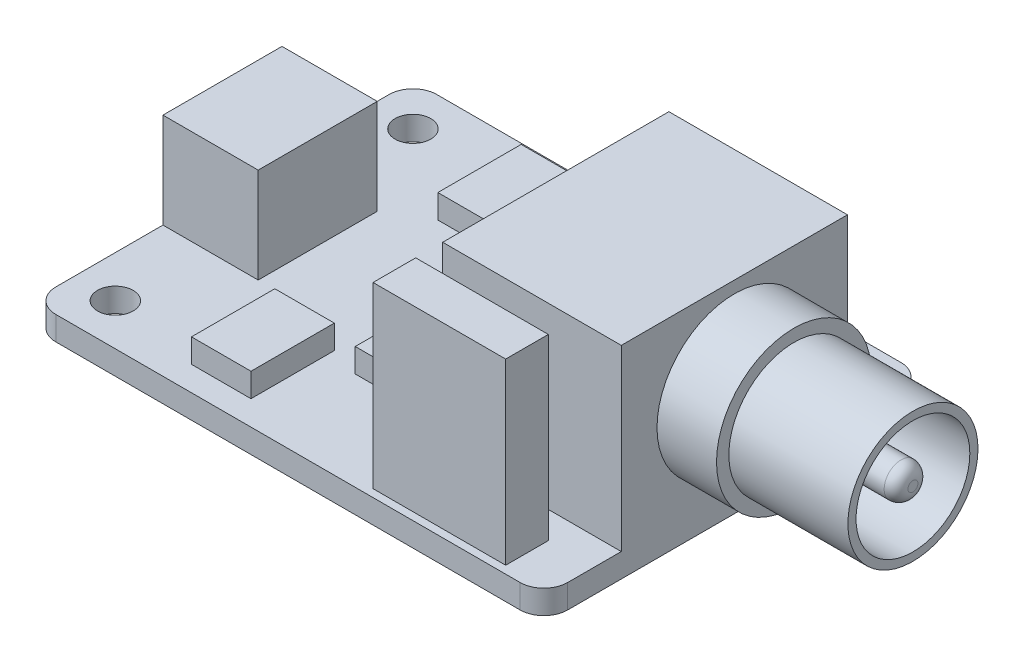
from build123d import *
from OCP.BRepFilletAPI import BRepFilletAPI_MakeChamfer

# Parameters (mm, degrees)
SKETCH1_W           = 43
SKETCH1_H           = 32
SKETCH1_R           = 1.5
BOSS_EXTRUDE1_DEPTH = 2
FILLET1_R           = 2
SKETCH2_W           = 15
SKETCH2_H           = 19
SKETCH2_W_2         = 11.140552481
SKETCH2_H_2         = 3.582781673
BOSS_EXTRUDE2_DEPTH = 15
SKETCH3_W           = 8
SKETCH3_H           = 10
BOSS_EXTRUDE3_DEPTH = 8
SKETCH4_W           = 5
SKETCH4_H           = 7
BOSS_EXTRUDE4_DEPTH = 2
SKETCH5_W           = 8
SKETCH5_H           = 6
SKETCH5_W_2         = 1
SKETCH5_H_2         = 1
CUT_EXTRUDE1_DEPTH  = 7
DRAFT1_ANGLE        = 1
CHAMFER1_SIZE       = 2.5
CHAMFER1_SIZE2      = 0.351352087
CHAMFER1_SIZE2_2    = 0.352269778
CHAMFER1_SIZE2_3    = 0.350545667
SKETCH6_R           = 6.5
BOSS_EXTRUDE5_DEPTH = 5
SKETCH7_R           = 5.464716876
BOSS_EXTRUDE6_DEPTH = 10
SKETCH8_R           = 4.778839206
SKETCH8_R_2         = 1.418417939
CUT_EXTRUDE2_DEPTH  = 15
FILLET3_R           = 1


with BuildPart() as part:
    # Sketch1 → Boss-Extrude1 (new body)
    with BuildSketch(Plane(origin=(0, 0, 0), x_dir=(1, 0, 0), z_dir=(0, 1, 0))):
        with Locations((-157.69047619, 62.928571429)):
            Rectangle(SKETCH1_W, SKETCH1_H)
        with Locations(Location((-175.69047619, 75.428571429, 0), (0, 0, 270))):
            Circle(SKETCH1_R, mode=Mode.SUBTRACT)
        with Locations(Location((-175.69047619, 50.428571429, 0), (0, 0, 270))):
            Circle(SKETCH1_R, mode=Mode.SUBTRACT)
    extrude(amount=BOSS_EXTRUDE1_DEPTH)

    # Fillet1
    fillet1_edges = [part.edges().sort_by_distance(p)[0] for p in [
        (-179.19047619, 1, -78.928571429),
        (-136.19047619, 1, -78.928571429),
        (-136.19047619, 1, -46.928571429),
        (-179.19047619, 1, -46.928571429),
    ]]
    fillet(fillet1_edges, radius=FILLET1_R)

    # Sketch2 → Boss-Extrude2 (add)
    with BuildSketch(Plane(origin=(0, 2, 0), x_dir=(1, 0, 0), z_dir=(0, 1, 0))):
        with Locations((-143.69047619, 62.928571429)):
            Rectangle(SKETCH2_W, SKETCH2_H)
        with Locations((-145.62019995, 49.369059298)):
            Rectangle(SKETCH2_W_2, SKETCH2_H_2)
    extrude(amount=BOSS_EXTRUDE2_DEPTH)

    # Sketch3 → Boss-Extrude3 (add)
    with BuildSketch(Plane(origin=(0, 2, 0), x_dir=(1, 0, 0), z_dir=(0, 1, 0))):
        with Locations((-175.19047619, 62.928571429)):
            Rectangle(SKETCH3_W, SKETCH3_H)
    extrude(amount=BOSS_EXTRUDE3_DEPTH)

    # Sketch4 → Boss-Extrude4 (add)
    with BuildSketch(Plane(origin=(0, 2, 0), x_dir=(1, 0, 0), z_dir=(0, 1, 0))):
        with Locations((-157.781788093, 68.484522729)):
            Rectangle(SKETCH4_W, SKETCH4_H)
        with Locations((-157.781788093, 58.672517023)):
            Rectangle(SKETCH4_W, SKETCH4_H)
        with Locations((-165.512552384, 73.341751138)):
            Rectangle(SKETCH4_W, SKETCH4_H)
        with Locations((-165.361321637, 52.495882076)):
            Rectangle(SKETCH4_W, SKETCH4_H)
    extrude(amount=BOSS_EXTRUDE4_DEPTH)

    # Sketch5 → Cut-Extrude1 (cut)
    with BuildSketch(Plane.ZY.offset(179.19047619)):
        with Locations((-62.928571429, 6)):
            Rectangle(SKETCH5_W, SKETCH5_H)
        with Locations((-65.228571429, 6)):
            Rectangle(SKETCH5_W_2, SKETCH5_H_2, mode=Mode.SUBTRACT)
        with Locations((-62.928571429, 6)):
            Rectangle(SKETCH5_W_2, SKETCH5_H_2, mode=Mode.SUBTRACT)
        with Locations((-60.628571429, 6)):
            Rectangle(SKETCH5_W_2, SKETCH5_H_2, mode=Mode.SUBTRACT)
    extrude(amount=-CUT_EXTRUDE1_DEPTH, mode=Mode.SUBTRACT)

    # Draft1
    draft1_faces = [part.faces().sort_by_distance(p)[0] for p in [
        (-179.19047619, 6, -65.228571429),
        (-179.19047619, 6, -60.628571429),
        (-179.19047619, 6, -62.928571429),
    ]]
    draft(draft1_faces, Plane(origin=(-172.19047619, 6.5, -63.428571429), x_dir=(0, 0, 1), z_dir=(0, 1, 0)), DRAFT1_ANGLE)

    # Chamfer1: one chamfer whose edges measure the first distance from different faces: ONE call of the kernel's chamfer builder (chamfer() names one face for all edges)
    chamfer1_edges_1 = [part.edges().sort_by_distance(p)[0] for p in [
        (-179.199203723, 6, -65.728571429),
    ]]
    chamfer1_side_1 = [part.faces().sort_by_distance(p)[0] for p in [
        (-175.694841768, 5.99979246, -65.728571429),
    ]]
    chamfer1_edges_2 = [part.edges().sort_by_distance(p)[0] for p in [
        (-179.19047619, 6.5, -65.228571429),
    ]]
    chamfer1_side_2 = [part.faces().sort_by_distance(p)[0] for p in [
        (-175.69047619, 6.5, -65.228571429),
    ]]
    chamfer1_edges_3 = [part.edges().sort_by_distance(p)[0] for p in [
        (-179.199203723, 6, -64.728571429),
    ]]
    chamfer1_side_3 = [part.faces().sort_by_distance(p)[0] for p in [
        (-175.694841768, 5.99979246, -64.728571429),
    ]]
    chamfer1_edges_4 = [part.edges().sort_by_distance(p)[0] for p in [
        (-179.207931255, 5.5, -65.228571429),
    ]]
    chamfer1_side_4 = [part.faces().sort_by_distance(p)[0] for p in [
        (-175.699203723, 5.5, -65.228571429),
    ]]
    chamfer1_edges_5 = [part.edges().sort_by_distance(p)[0] for p in [
        (-179.199203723, 6, -63.428571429),
    ]]
    chamfer1_side_5 = [part.faces().sort_by_distance(p)[0] for p in [
        (-175.694841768, 5.99979246, -63.428571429),
    ]]
    chamfer1_edges_6 = [part.edges().sort_by_distance(p)[0] for p in [
        (-179.19047619, 6.5, -62.928571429),
    ]]
    chamfer1_side_6 = [part.faces().sort_by_distance(p)[0] for p in [
        (-175.69047619, 6.5, -62.928571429),
    ]]
    chamfer1_edges_7 = [part.edges().sort_by_distance(p)[0] for p in [
        (-179.199203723, 6, -62.428571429),
    ]]
    chamfer1_side_7 = [part.faces().sort_by_distance(p)[0] for p in [
        (-175.694841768, 5.99979246, -62.428571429),
    ]]
    chamfer1_edges_8 = [part.edges().sort_by_distance(p)[0] for p in [
        (-179.207931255, 5.5, -62.928571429),
    ]]
    chamfer1_side_8 = [part.faces().sort_by_distance(p)[0] for p in [
        (-175.699203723, 5.5, -62.928571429),
    ]]
    chamfer1_edges_9 = [part.edges().sort_by_distance(p)[0] for p in [
        (-179.199203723, 6, -61.128571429),
    ]]
    chamfer1_side_9 = [part.faces().sort_by_distance(p)[0] for p in [
        (-175.694841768, 5.99979246, -61.128571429),
    ]]
    chamfer1_edges_10 = [part.edges().sort_by_distance(p)[0] for p in [
        (-179.19047619, 6.5, -60.628571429),
    ]]
    chamfer1_side_10 = [part.faces().sort_by_distance(p)[0] for p in [
        (-175.69047619, 6.5, -60.628571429),
    ]]
    chamfer1_edges_11 = [part.edges().sort_by_distance(p)[0] for p in [
        (-179.199203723, 6, -60.128571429),
    ]]
    chamfer1_side_11 = [part.faces().sort_by_distance(p)[0] for p in [
        (-175.694841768, 5.99979246, -60.128571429),
    ]]
    chamfer1_edges_12 = [part.edges().sort_by_distance(p)[0] for p in [
        (-179.207931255, 5.5, -60.628571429),
    ]]
    chamfer1_side_12 = [part.faces().sort_by_distance(p)[0] for p in [
        (-175.699203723, 5.5, -60.628571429),
    ]]
    chamfer1 = BRepFilletAPI_MakeChamfer(part.part.solid().wrapped)
    for e in chamfer1_edges_1:
        chamfer1.Add(CHAMFER1_SIZE, CHAMFER1_SIZE2, e.wrapped, chamfer1_side_1[0].wrapped)  # the first distance lies on this face
    for e in chamfer1_edges_2:
        chamfer1.Add(CHAMFER1_SIZE, CHAMFER1_SIZE2_2, e.wrapped, chamfer1_side_2[0].wrapped)  # the first distance lies on this face
    for e in chamfer1_edges_3:
        chamfer1.Add(CHAMFER1_SIZE, CHAMFER1_SIZE2, e.wrapped, chamfer1_side_3[0].wrapped)  # the first distance lies on this face
    for e in chamfer1_edges_4:
        chamfer1.Add(CHAMFER1_SIZE, CHAMFER1_SIZE2_3, e.wrapped, chamfer1_side_4[0].wrapped)  # the first distance lies on this face
    for e in chamfer1_edges_5:
        chamfer1.Add(CHAMFER1_SIZE, CHAMFER1_SIZE2, e.wrapped, chamfer1_side_5[0].wrapped)  # the first distance lies on this face
    for e in chamfer1_edges_6:
        chamfer1.Add(CHAMFER1_SIZE, CHAMFER1_SIZE2_2, e.wrapped, chamfer1_side_6[0].wrapped)  # the first distance lies on this face
    for e in chamfer1_edges_7:
        chamfer1.Add(CHAMFER1_SIZE, CHAMFER1_SIZE2, e.wrapped, chamfer1_side_7[0].wrapped)  # the first distance lies on this face
    for e in chamfer1_edges_8:
        chamfer1.Add(CHAMFER1_SIZE, CHAMFER1_SIZE2_3, e.wrapped, chamfer1_side_8[0].wrapped)  # the first distance lies on this face
    for e in chamfer1_edges_9:
        chamfer1.Add(CHAMFER1_SIZE, CHAMFER1_SIZE2, e.wrapped, chamfer1_side_9[0].wrapped)  # the first distance lies on this face
    for e in chamfer1_edges_10:
        chamfer1.Add(CHAMFER1_SIZE, CHAMFER1_SIZE2_2, e.wrapped, chamfer1_side_10[0].wrapped)  # the first distance lies on this face
    for e in chamfer1_edges_11:
        chamfer1.Add(CHAMFER1_SIZE, CHAMFER1_SIZE2, e.wrapped, chamfer1_side_11[0].wrapped)  # the first distance lies on this face
    for e in chamfer1_edges_12:
        chamfer1.Add(CHAMFER1_SIZE, CHAMFER1_SIZE2_3, e.wrapped, chamfer1_side_12[0].wrapped)  # the first distance lies on this face
    add(Compound.cast(chamfer1.Shape()), mode=Mode.REPLACE)

    # Sketch6 → Boss-Extrude5 (add)
    with BuildSketch(Plane(origin=(-136.19047619, 0, 0), x_dir=(0, 0, -1), z_dir=(1, 0, 0))):
        with Locations(Location((62.928571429, 9.5, 0), (0, 0, 180))):
            Circle(SKETCH6_R)
    extrude(amount=BOSS_EXTRUDE5_DEPTH)

    # Sketch7 → Boss-Extrude6 (add)
    with BuildSketch(Plane(origin=(-131.19047619, 0, 0), x_dir=(0, 0, -1), z_dir=(1, 0, 0))):
        with Locations((62.928571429, 9.5)):
            Circle(SKETCH7_R)
    extrude(amount=BOSS_EXTRUDE6_DEPTH)

    # Sketch8 → Cut-Extrude2 (cut)
    with BuildSketch(Plane(origin=(-121.19047619, 0, 0), x_dir=(0, 0, -1), z_dir=(1, 0, 0))):
        with Locations((62.928571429, 9.5)):
            Circle(SKETCH8_R)
        with Locations((62.928571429, 9.5)):
            Circle(SKETCH8_R_2, mode=Mode.SUBTRACT)
    extrude(amount=-CUT_EXTRUDE2_DEPTH, mode=Mode.SUBTRACT)

    # Fillet3
    fillet3_edges = [part.edges().sort_by_distance(p)[0] for p in [
        (-121.19047619, 9.5, -61.51015349),
    ]]
    fillet(fillet3_edges, radius=FILLET3_R)


solid = part.part
